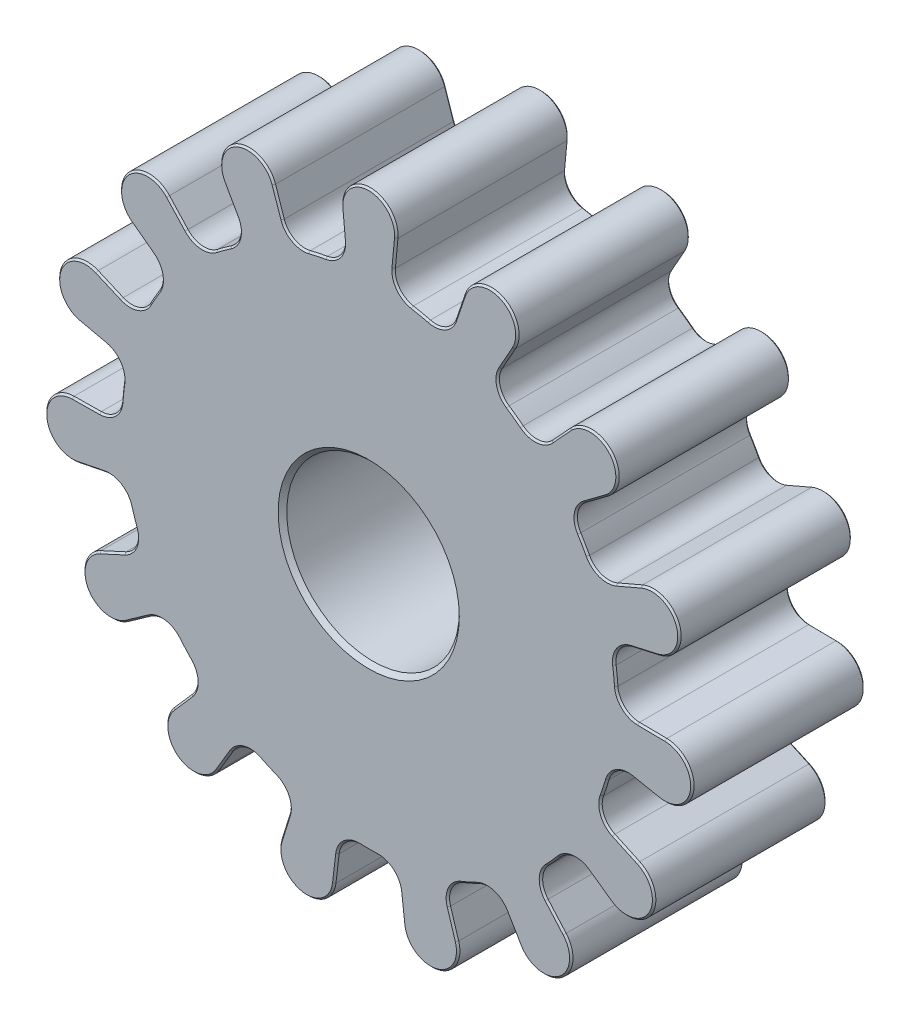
from build123d import *

# Parameters (mm, degrees)
SKETCH_1_R      = 5
EXTRUDE_1_DEPTH = 10
CHAMFER_1_SIZE  = 0.25
CHAMFER_2_SIZE  = 0.1


with BuildPart() as part:
    # Sketch 1 → Extrude 1 (new body)
    with BuildSketch(Plane.XY):
        with BuildLine():
            Line((-1.446341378, 15.526146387), (-1.593102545, 17.101594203))
            ThreePointArc((-1.593102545, 17.101594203), (0, 18.85), (1.593102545, 17.101594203))
            Line((1.593102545, 17.101594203), (1.446341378, 15.526146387))
            ThreePointArc((1.446341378, 15.526146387), (1.701285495, 14.637864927), (2.490808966, 14.157559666))
            ThreePointArc((2.490808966, 14.157559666), (2.988730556, 14.060871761), (3.482931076, 13.946677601))
            ThreePointArc((3.482931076, 13.946677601), (4.399554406, 14.064330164), (4.993754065, 14.772120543))
            Line((4.993754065, 14.772120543), (5.500473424, 16.271056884))
            ThreePointArc((5.500473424, 16.271056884), (7.666985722, 17.220331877), (8.411216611, 14.975110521))
            Line((8.411216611, 14.975110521), (7.636351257, 13.595560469))
            ThreePointArc((7.636351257, 13.595560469), (7.507957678, 12.680379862), (8.033865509, 11.920471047))
            ThreePointArc((8.033865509, 11.920471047), (8.449413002, 11.629619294), (8.854440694, 11.324288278))
            ThreePointArc((8.854440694, 11.324288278), (9.739671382, 11.058944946), (10.570384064, 11.463860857))
            Line((10.570384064, 11.463860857), (11.642967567, 12.627106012))
            ThreePointArc((11.642967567, 12.627106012), (14.00827996, 12.61311193), (13.774954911, 10.259294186))
            Line((13.774954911, 10.259294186), (12.50596663, 9.314178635))
            ThreePointArc((12.50596663, 9.314178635), (12.016435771, 8.530341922), (12.187793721, 7.62222469))
            ThreePointArc((12.187793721, 7.62222469), (12.449115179, 7.1875), (12.694937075, 6.743826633))
            ThreePointArc((12.694937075, 6.743826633), (13.395710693, 6.141367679), (14.319298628, 6.173395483))
            Line((14.319298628, 6.173395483), (15.772286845, 6.799813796))
            ThreePointArc((15.772286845, 6.799813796), (17.927415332, 5.824970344), (16.756878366, 3.769552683))
            Line((16.756878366, 3.769552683), (15.213186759, 3.422290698))
            ThreePointArc((15.213186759, 3.422290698), (14.447162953, 2.905330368), (14.234341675, 2.006026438))
            ThreePointArc((14.234341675, 2.006026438), (14.296252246, 1.502596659), (14.340363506, 0.997296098))
            ThreePointArc((14.340363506, 0.997296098), (14.735509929, 0.161892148), (15.592276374, -0.184506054))
            Line((15.592276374, -0.184506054), (17.174434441, -0.203227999))
            ThreePointArc((17.174434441, -0.203227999), (18.746737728, -1.970361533), (16.84138532, -3.371978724))
            Line((16.84138532, -3.371978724), (15.289908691, -3.061342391))
            ThreePointArc((15.289908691, -3.061342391), (14.379844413, -3.222039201), (13.819642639, -3.957032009))
            ThreePointArc((13.819642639, -3.957032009), (13.671437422, -4.442119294), (13.506210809, -4.921675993))
            ThreePointArc((13.506210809, -4.921675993), (13.527405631, -5.845576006), (14.169207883, -6.510504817))
            Line((14.169207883, -6.510504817), (15.606966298, -7.171129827))
            ThreePointArc((15.606966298, -7.171129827), (16.324578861, -9.425), (14.013863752, -9.930464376))
            Line((14.013863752, -9.930464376), (12.722866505, -9.015641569))
            ThreePointArc((12.722866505, -9.015641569), (11.826120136, -8.792288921), (11.015401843, -9.235883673))
            ThreePointArc((11.015401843, -9.235883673), (10.682706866, -9.618752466), (10.336711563, -9.989645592))
            ThreePointArc((10.336711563, -9.989645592), (9.980290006, -10.842290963), (10.296154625, -11.710778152))
            Line((10.296154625, -11.710778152), (11.340911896, -12.89907816))
            ThreePointArc((11.340911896, -12.89907816), (11.079752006, -15.249970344), (8.76321783, -14.771882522))
            Line((8.76321783, -14.771882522), (7.955925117, -13.411054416))
            ThreePointArc((7.955925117, -13.411054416), (7.227552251, -12.842272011), (6.306497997, -12.917767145))
            ThreePointArc((6.306497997, -12.917767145), (5.846839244, -13.132215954), (5.379900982, -13.330314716))
            ThreePointArc((5.379900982, -13.330314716), (4.707491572, -13.964275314), (4.642802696, -14.886151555))
            Line((4.642802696, -14.886151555), (5.113910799, -16.396658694))
            ThreePointArc((5.113910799, -16.396658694), (3.919135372, -18.438082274), (1.997331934, -17.059107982))
            Line((1.997331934, -17.059107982), (1.813331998, -15.487574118))
            ThreePointArc((1.813331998, -15.487574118), (1.379274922, -14.671709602), (0.507143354, -14.366051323))
            ThreePointArc((0.507143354, -14.366051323), (0, -14.375), (-0.507143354, -14.366051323))
            ThreePointArc((-0.507143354, -14.366051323), (-1.379274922, -14.671709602), (-1.813331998, -15.487574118))
            Line((-1.813331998, -15.487574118), (-1.997331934, -17.059107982))
            ThreePointArc((-1.997331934, -17.059107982), (-3.919135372, -18.438082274), (-5.113910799, -16.396658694))
            Line((-5.113910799, -16.396658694), (-4.642802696, -14.886151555))
            ThreePointArc((-4.642802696, -14.886151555), (-4.707491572, -13.964275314), (-5.379900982, -13.330314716))
            ThreePointArc((-5.379900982, -13.330314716), (-5.846839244, -13.132215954), (-6.306497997, -12.917767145))
            ThreePointArc((-6.306497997, -12.917767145), (-7.227552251, -12.842272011), (-7.955925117, -13.411054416))
            Line((-7.955925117, -13.411054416), (-8.76321783, -14.771882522))
            ThreePointArc((-8.76321783, -14.771882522), (-11.079752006, -15.249970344), (-11.340911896, -12.89907816))
            Line((-11.340911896, -12.89907816), (-10.296154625, -11.710778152))
            ThreePointArc((-10.296154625, -11.710778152), (-9.980290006, -10.842290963), (-10.336711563, -9.989645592))
            ThreePointArc((-10.336711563, -9.989645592), (-10.682706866, -9.618752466), (-11.015401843, -9.235883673))
            ThreePointArc((-11.015401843, -9.235883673), (-11.826120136, -8.792288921), (-12.722866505, -9.015641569))
            Line((-12.722866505, -9.015641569), (-14.013863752, -9.930464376))
            ThreePointArc((-14.013863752, -9.930464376), (-16.324578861, -9.425), (-15.606966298, -7.171129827))
            Line((-15.606966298, -7.171129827), (-14.169207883, -6.510504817))
            ThreePointArc((-14.169207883, -6.510504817), (-13.527405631, -5.845576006), (-13.506210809, -4.921675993))
            ThreePointArc((-13.506210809, -4.921675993), (-13.671437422, -4.442119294), (-13.819642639, -3.957032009))
            ThreePointArc((-13.819642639, -3.957032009), (-14.379844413, -3.222039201), (-15.289908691, -3.061342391))
            Line((-15.289908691, -3.061342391), (-16.84138532, -3.371978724))
            ThreePointArc((-16.84138532, -3.371978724), (-18.746737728, -1.970361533), (-17.174434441, -0.203227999))
            Line((-17.174434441, -0.203227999), (-15.592276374, -0.184506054))
            ThreePointArc((-15.592276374, -0.184506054), (-14.735509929, 0.161892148), (-14.340363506, 0.997296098))
            ThreePointArc((-14.340363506, 0.997296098), (-14.296252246, 1.502596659), (-14.234341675, 2.006026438))
            ThreePointArc((-14.234341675, 2.006026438), (-14.447162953, 2.905330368), (-15.213186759, 3.422290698))
            Line((-15.213186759, 3.422290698), (-16.756878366, 3.769552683))
            ThreePointArc((-16.756878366, 3.769552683), (-17.927415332, 5.824970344), (-15.772286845, 6.799813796))
            Line((-15.772286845, 6.799813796), (-14.319298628, 6.173395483))
            ThreePointArc((-14.319298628, 6.173395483), (-13.395710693, 6.141367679), (-12.694937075, 6.743826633))
            ThreePointArc((-12.694937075, 6.743826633), (-12.449115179, 7.1875), (-12.187793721, 7.62222469))
            ThreePointArc((-12.187793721, 7.62222469), (-12.016435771, 8.530341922), (-12.50596663, 9.314178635))
            Line((-12.50596663, 9.314178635), (-13.774954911, 10.259294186))
            ThreePointArc((-13.774954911, 10.259294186), (-14.00827996, 12.61311193), (-11.642967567, 12.627106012))
            Line((-11.642967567, 12.627106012), (-10.570384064, 11.463860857))
            ThreePointArc((-10.570384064, 11.463860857), (-9.739671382, 11.058944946), (-8.854440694, 11.324288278))
            ThreePointArc((-8.854440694, 11.324288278), (-8.449413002, 11.629619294), (-8.033865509, 11.920471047))
            ThreePointArc((-8.033865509, 11.920471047), (-7.507957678, 12.680379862), (-7.636351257, 13.595560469))
            Line((-7.636351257, 13.595560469), (-8.411216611, 14.975110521))
            ThreePointArc((-8.411216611, 14.975110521), (-7.666985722, 17.220331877), (-5.500473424, 16.271056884))
            Line((-5.500473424, 16.271056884), (-4.993754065, 14.772120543))
            ThreePointArc((-4.993754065, 14.772120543), (-4.399554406, 14.064330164), (-3.482931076, 13.946677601))
            ThreePointArc((-3.482931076, 13.946677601), (-2.988730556, 14.060871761), (-2.490808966, 14.157559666))
            ThreePointArc((-2.490808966, 14.157559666), (-1.701285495, 14.637864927), (-1.446341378, 15.526146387))
        make_face()
        Circle(SKETCH_1_R, mode=Mode.SUBTRACT)
    extrude(amount=EXTRUDE_1_DEPTH)

    # Chamfer 1
    chamfer_1_edges = [part.edges().sort_by_distance(p)[0] for p in [
        (-5, 0, 0),
        (-5, 0, 10),
    ]]
    chamfer(chamfer_1_edges, length=CHAMFER_1_SIZE)

    # Chamfer 2
    chamfer_2_edges = [part.edges().sort_by_distance(p)[0] for p in [
        (-1.701285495, 14.637864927, 10),
        (-11.826120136, -8.792288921, 10),
        (-14.735509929, 0.161892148, 0),
        (-14.296252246, 1.502596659, 0),
        (-14.447162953, 2.905330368, 0),
        (-15.985032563, 3.595921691, 0),
        (-17.927415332, 5.824970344, 0),
        (-15.045792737, 6.48660464, 0),
        (-13.395710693, 6.141367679, 0),
        (-12.449115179, 7.1875, 0),
        (-10.682706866, -9.618752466, 10),
        (-12.016435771, 8.530341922, 0),
        (-13.140460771, 9.78673641, 0),
        (-14.00827996, 12.61311193, 0),
        (-11.106675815, 12.045483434, 0),
        (-9.739671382, 11.058944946, 0),
        (-8.449413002, 11.629619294, 0),
        (-7.507957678, 12.680379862, 0),
        (-9.980290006, -10.842290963, 10),
        (-8.023783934, 14.285335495, 0),
        (-7.666985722, 17.220331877, 0),
        (-5.247113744, 15.521588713, 0),
        (-4.399554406, 14.064330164, 0),
        (-2.988730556, 14.060871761, 0),
        (-1.701285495, 14.637864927, 0),
        (-1.519721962, 16.313870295, 0),
        (0, 18.85, 0),
        (-10.818533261, -12.304928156, 10),
        (-11.079752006, -15.249970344, 10),
        (-8.359571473, -14.091468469, 10),
        (-7.227552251, -12.842272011, 10),
        (-5.846839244, -13.132215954, 10),
        (-4.707491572, -13.964275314, 10),
        (-4.878356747, -15.641405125, 10),
        (-2.988730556, 14.060871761, 10),
        (-3.919135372, -18.438082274, 10),
        (-1.905331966, -16.27334105, 10),
        (-1.379274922, -14.671709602, 10),
        (0, -14.375, 10),
        (1.379274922, -14.671709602, 10),
        (1.905331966, -16.27334105, 10),
        (3.919135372, -18.438082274, 10),
        (4.878356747, -15.641405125, 10),
        (4.707491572, -13.964275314, 10),
        (5.846839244, -13.132215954, 10),
        (-4.399554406, 14.064330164, 10),
        (7.227552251, -12.842272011, 10),
        (8.359571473, -14.091468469, 10),
        (11.079752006, -15.249970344, 10),
        (10.818533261, -12.304928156, 10),
        (9.980290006, -10.842290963, 10),
        (10.682706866, -9.618752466, 10),
        (11.826120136, -8.792288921, 10),
        (13.368365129, -9.473052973, 10),
        (16.324578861, -9.425, 10),
        (14.88808709, -6.840817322, 10),
        (-5.247113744, 15.521588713, 10),
        (13.527405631, -5.845576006, 10),
        (13.671437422, -4.442119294, 10),
        (14.379844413, -3.222039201, 10),
        (16.065647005, -3.216660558, 10),
        (18.746737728, -1.970361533, 10),
        (16.383355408, -0.193867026, 10),
        (14.735509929, 0.161892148, 10),
        (14.296252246, 1.502596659, 10),
        (14.447162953, 2.905330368, 10),
        (15.985032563, 3.595921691, 10),
        (-7.666985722, 17.220331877, 10),
        (17.927415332, 5.824970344, 10),
        (15.045792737, 6.48660464, 10),
        (13.395710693, 6.141367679, 10),
        (12.449115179, 7.1875, 10),
        (12.016435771, 8.530341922, 10),
        (13.140460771, 9.78673641, 10),
        (14.00827996, 12.61311193, 10),
        (11.106675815, 12.045483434, 10),
        (9.739671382, 11.058944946, 10),
        (8.449413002, 11.629619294, 10),
        (-8.023783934, 14.285335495, 10),
        (7.507957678, 12.680379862, 10),
        (8.023783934, 14.285335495, 10),
        (7.666985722, 17.220331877, 10),
        (5.247113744, 15.521588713, 10),
        (4.399554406, 14.064330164, 10),
        (2.988730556, 14.060871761, 10),
        (1.701285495, 14.637864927, 10),
        (1.519721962, 16.313870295, 10),
        (-7.507957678, 12.680379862, 10),
        (-8.449413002, 11.629619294, 10),
        (-9.739671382, 11.058944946, 10),
        (-11.106675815, 12.045483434, 10),
        (0, 18.85, 10),
        (-14.00827996, 12.61311193, 10),
        (-13.140460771, 9.78673641, 10),
        (-12.016435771, 8.530341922, 10),
        (-12.449115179, 7.1875, 10),
        (-13.395710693, 6.141367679, 10),
        (-15.045792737, 6.48660464, 10),
        (-17.927415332, 5.824970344, 10),
        (-15.985032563, 3.595921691, 10),
        (-14.447162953, 2.905330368, 10),
        (-14.296252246, 1.502596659, 10),
        (-1.519721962, 16.313870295, 10),
        (-14.735509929, 0.161892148, 10),
        (-16.383355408, -0.193867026, 10),
        (1.519721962, 16.313870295, 0),
        (1.701285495, 14.637864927, 0),
        (2.988730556, 14.060871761, 0),
        (4.399554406, 14.064330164, 0),
        (5.247113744, 15.521588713, 0),
        (7.666985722, 17.220331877, 0),
        (8.023783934, 14.285335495, 0),
        (-18.746737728, -1.970361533, 10),
        (7.507957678, 12.680379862, 0),
        (8.449413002, 11.629619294, 0),
        (9.739671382, 11.058944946, 0),
        (11.106675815, 12.045483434, 0),
        (14.00827996, 12.61311193, 0),
        (13.140460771, 9.78673641, 0),
        (12.016435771, 8.530341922, 0),
        (12.449115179, 7.1875, 0),
        (-16.065647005, -3.216660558, 10),
        (13.395710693, 6.141367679, 0),
        (15.045792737, 6.48660464, 0),
        (17.927415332, 5.824970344, 0),
        (15.985032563, 3.595921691, 0),
        (14.447162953, 2.905330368, 0),
        (14.296252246, 1.502596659, 0),
        (14.735509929, 0.161892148, 0),
        (-14.379844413, -3.222039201, 10),
        (16.383355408, -0.193867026, 0),
        (18.746737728, -1.970361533, 0),
        (16.065647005, -3.216660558, 0),
        (14.379844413, -3.222039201, 0),
        (13.671437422, -4.442119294, 0),
        (13.527405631, -5.845576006, 0),
        (14.88808709, -6.840817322, 0),
        (16.324578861, -9.425, 0),
        (-13.671437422, -4.442119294, 10),
        (13.368365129, -9.473052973, 0),
        (11.826120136, -8.792288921, 0),
        (10.682706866, -9.618752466, 0),
        (9.980290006, -10.842290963, 0),
        (10.818533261, -12.304928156, 0),
        (11.079752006, -15.249970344, 0),
        (8.359571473, -14.091468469, 0),
        (-13.527405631, -5.845576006, 10),
        (7.227552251, -12.842272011, 0),
        (5.846839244, -13.132215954, 0),
        (4.707491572, -13.964275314, 0),
        (4.878356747, -15.641405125, 0),
        (3.919135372, -18.438082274, 0),
        (1.905331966, -16.27334105, 0),
        (1.379274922, -14.671709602, 0),
        (0, -14.375, 0),
        (-14.88808709, -6.840817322, 10),
        (-1.379274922, -14.671709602, 0),
        (-1.905331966, -16.27334105, 0),
        (-3.919135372, -18.438082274, 0),
        (-4.878356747, -15.641405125, 0),
        (-4.707491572, -13.964275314, 0),
        (-5.846839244, -13.132215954, 0),
        (-7.227552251, -12.842272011, 0),
        (-16.324578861, -9.425, 10),
        (-8.359571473, -14.091468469, 0),
        (-11.079752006, -15.249970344, 0),
        (-10.818533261, -12.304928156, 0),
        (-9.980290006, -10.842290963, 0),
        (-10.682706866, -9.618752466, 0),
        (-11.826120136, -8.792288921, 0),
        (-13.368365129, -9.473052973, 0),
        (-16.324578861, -9.425, 0),
        (-13.368365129, -9.473052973, 10),
        (-14.88808709, -6.840817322, 0),
        (-13.527405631, -5.845576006, 0),
        (-13.671437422, -4.442119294, 0),
        (-14.379844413, -3.222039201, 0),
        (-16.065647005, -3.216660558, 0),
        (-18.746737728, -1.970361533, 0),
        (-16.383355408, -0.193867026, 0),
    ]]
    chamfer(chamfer_2_edges, length=CHAMFER_2_SIZE)


solid = part.part
